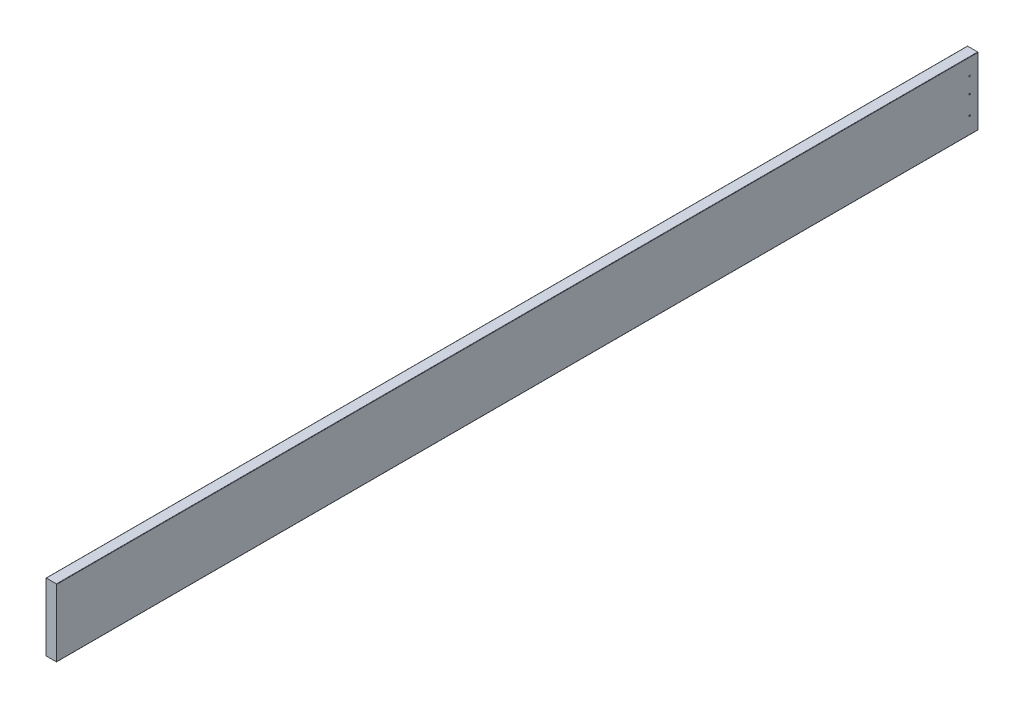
ISO-10303-21;
HEADER;
FILE_DESCRIPTION(('STEP AP214'),'2;1');
FILE_NAME('part.step','',(''),(''),'','','');
FILE_SCHEMA(('AUTOMOTIVE_DESIGN { 1 0 10303 214 1 1 1 1 }'));
ENDSEC;
DATA;
#1=APPLICATION_CONTEXT('core data for automotive mechanical design processes');
#2=APPLICATION_PROTOCOL_DEFINITION('international standard','automotive_design',2000,#1);
#3=PRODUCT_CONTEXT('',#1,'mechanical');
#4=PRODUCT('Part','Part','',(#3));
#5=PRODUCT_RELATED_PRODUCT_CATEGORY('part','',(#4));
#6=PRODUCT_DEFINITION_FORMATION('','',#4);
#7=PRODUCT_DEFINITION_CONTEXT('part definition',#1,'design');
#8=PRODUCT_DEFINITION('design','',#6,#7);
#9=PRODUCT_DEFINITION_SHAPE('','',#8);
#10=(LENGTH_UNIT() NAMED_UNIT(*) SI_UNIT(.MILLI.,.METRE.));
#11=(NAMED_UNIT(*) PLANE_ANGLE_UNIT() SI_UNIT($,.RADIAN.));
#12=(NAMED_UNIT(*) SI_UNIT($,.STERADIAN.) SOLID_ANGLE_UNIT());
#13=UNCERTAINTY_MEASURE_WITH_UNIT(LENGTH_MEASURE(1.E-05),#10,'distance_accuracy_value','');
#14=(GEOMETRIC_REPRESENTATION_CONTEXT(3) GLOBAL_UNCERTAINTY_ASSIGNED_CONTEXT((#13)) GLOBAL_UNIT_ASSIGNED_CONTEXT((#10,
#11,#12)) REPRESENTATION_CONTEXT('',''));
#15=CARTESIAN_POINT('',(0.,0.,0.));
#16=DIRECTION('',(0.,0.,1.));
#17=DIRECTION('',(1.,0.,0.));
#18=AXIS2_PLACEMENT_3D('',#15,#16,#17);
#19=CARTESIAN_POINT('',(-19.05,-120.65,3289.3));
#20=DIRECTION('',(1.,0.,0.));
#21=DIRECTION('',(0.,0.,-1.));
#22=AXIS2_PLACEMENT_3D('',#19,#20,#21);
#23=PLANE('',#22);
#24=CARTESIAN_POINT('',(-19.05,61.645760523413,29.9999999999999));
#25=DIRECTION('',(-1.,0.,0.));
#26=DIRECTION('',(0.,0.,1.));
#27=AXIS2_PLACEMENT_3D('',#24,#25,#26);
#28=CIRCLE('',#27,2.50000000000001);
#29=CARTESIAN_POINT('',(-19.05,61.645760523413,32.4999999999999));
#30=VERTEX_POINT('',#29);
#31=EDGE_CURVE('E208',#30,#30,#28,.T.);
#32=ORIENTED_EDGE('',*,*,#31,.F.);
#33=EDGE_LOOP('',(#32));
#34=FACE_BOUND('',#33,.T.);
#35=CARTESIAN_POINT('',(-19.05,5.39576052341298,29.9999999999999));
#36=DIRECTION('',(-1.,0.,0.));
#37=DIRECTION('',(0.,0.,1.));
#38=AXIS2_PLACEMENT_3D('',#35,#36,#37);
#39=CIRCLE('',#38,2.5);
#40=CARTESIAN_POINT('',(-19.05,5.39576052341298,32.4999999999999));
#41=VERTEX_POINT('',#40);
#42=EDGE_CURVE('E202',#41,#41,#39,.T.);
#43=ORIENTED_EDGE('',*,*,#42,.F.);
#44=EDGE_LOOP('',(#43));
#45=FACE_BOUND('',#44,.T.);
#46=CARTESIAN_POINT('',(-19.05,-60.854239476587,29.9999999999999));
#47=DIRECTION('',(-1.,0.,0.));
#48=DIRECTION('',(0.,0.,1.));
#49=AXIS2_PLACEMENT_3D('',#46,#47,#48);
#50=CIRCLE('',#49,2.5);
#51=CARTESIAN_POINT('',(-19.05,-60.854239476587,32.4999999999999));
#52=VERTEX_POINT('',#51);
#53=EDGE_CURVE('E196',#52,#52,#50,.T.);
#54=ORIENTED_EDGE('',*,*,#53,.F.);
#55=EDGE_LOOP('',(#54));
#56=FACE_BOUND('',#55,.T.);
#57=DIRECTION('',(0.,-1.,0.));
#58=VECTOR('',#57,1.);
#59=CARTESIAN_POINT('',(-19.05,-120.65,0.));
#60=LINE('',#59,#58);
#61=CARTESIAN_POINT('',(-19.05,119.38,0.));
#62=VERTEX_POINT('',#61);
#63=CARTESIAN_POINT('',(-19.05,-119.38,0.));
#64=VERTEX_POINT('',#63);
#65=EDGE_CURVE('E128',#62,#64,#60,.T.);
#66=ORIENTED_EDGE('',*,*,#65,.T.);
#67=DIRECTION('',(0.,0.,-1.));
#68=VECTOR('',#67,1.);
#69=CARTESIAN_POINT('',(-19.05,-119.38,3289.3));
#70=LINE('',#69,#68);
#71=CARTESIAN_POINT('',(-19.05,-119.38,3289.3));
#72=VERTEX_POINT('',#71);
#73=EDGE_CURVE('E106',#64,#72,#70,.F.);
#74=ORIENTED_EDGE('',*,*,#73,.T.);
#75=DIRECTION('',(0.,-1.,0.));
#76=VECTOR('',#75,1.);
#77=CARTESIAN_POINT('',(-19.05,-120.65,3289.3));
#78=LINE('',#77,#76);
#79=CARTESIAN_POINT('',(-19.05,119.38,3289.3));
#80=VERTEX_POINT('',#79);
#81=EDGE_CURVE('E138',#80,#72,#78,.T.);
#82=ORIENTED_EDGE('',*,*,#81,.F.);
#83=DIRECTION('',(0.,0.,-1.));
#84=VECTOR('',#83,1.);
#85=CARTESIAN_POINT('',(-19.05,119.38,3289.3));
#86=LINE('',#85,#84);
#87=EDGE_CURVE('E111',#80,#62,#86,.T.);
#88=ORIENTED_EDGE('',*,*,#87,.T.);
#89=EDGE_LOOP('',(#66,#74,#82,#88));
#90=FACE_BOUND('',#89,.T.);
#91=ADVANCED_FACE('F35',(#34,#45,#56,#90),#23,.F.);
#92=CARTESIAN_POINT('',(-19.05,-120.65,3289.3));
#93=DIRECTION('',(0.,1.,0.));
#94=DIRECTION('',(0.,0.,1.));
#95=AXIS2_PLACEMENT_3D('',#92,#93,#94);
#96=PLANE('',#95);
#97=DIRECTION('',(1.,0.,0.));
#98=VECTOR('',#97,1.);
#99=CARTESIAN_POINT('',(-19.05,-120.65,3289.3));
#100=LINE('',#99,#98);
#101=CARTESIAN_POINT('',(-17.78,-120.65,3289.3));
#102=VERTEX_POINT('',#101);
#103=CARTESIAN_POINT('',(17.78,-120.65,3289.3));
#104=VERTEX_POINT('',#103);
#105=EDGE_CURVE('E121',#102,#104,#100,.T.);
#106=ORIENTED_EDGE('',*,*,#105,.F.);
#107=DIRECTION('',(0.,0.,-1.));
#108=VECTOR('',#107,1.);
#109=CARTESIAN_POINT('',(-17.78,-120.65,3289.3));
#110=LINE('',#109,#108);
#111=CARTESIAN_POINT('',(-17.78,-120.65,0.));
#112=VERTEX_POINT('',#111);
#113=EDGE_CURVE('E105',#102,#112,#110,.T.);
#114=ORIENTED_EDGE('',*,*,#113,.T.);
#115=DIRECTION('',(1.,0.,0.));
#116=VECTOR('',#115,1.);
#117=CARTESIAN_POINT('',(-19.05,-120.65,0.));
#118=LINE('',#117,#116);
#119=CARTESIAN_POINT('',(17.78,-120.65,0.));
#120=VERTEX_POINT('',#119);
#121=EDGE_CURVE('E118',#112,#120,#118,.T.);
#122=ORIENTED_EDGE('',*,*,#121,.T.);
#123=DIRECTION('',(0.,0.,-1.));
#124=VECTOR('',#123,1.);
#125=CARTESIAN_POINT('',(17.78,-120.65,3289.3));
#126=LINE('',#125,#124);
#127=EDGE_CURVE('E123',#120,#104,#126,.F.);
#128=ORIENTED_EDGE('',*,*,#127,.T.);
#129=EDGE_LOOP('',(#106,#114,#122,#128));
#130=FACE_BOUND('',#129,.T.);
#131=ADVANCED_FACE('F117',(#130),#96,.F.);
#132=CARTESIAN_POINT('',(19.05,-120.65,3289.3));
#133=DIRECTION('',(-1.,0.,0.));
#134=DIRECTION('',(0.,-1.,0.));
#135=AXIS2_PLACEMENT_3D('',#132,#133,#134);
#136=PLANE('',#135);
#137=CARTESIAN_POINT('',(19.05,61.6457605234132,30.0000000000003));
#138=DIRECTION('',(1.,0.,0.));
#139=DIRECTION('',(0.,1.,0.));
#140=AXIS2_PLACEMENT_3D('',#137,#138,#139);
#141=CIRCLE('',#140,2.5);
#142=CARTESIAN_POINT('',(19.05,64.1457605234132,30.0000000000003));
#143=VERTEX_POINT('',#142);
#144=EDGE_CURVE('E190',#143,#143,#141,.T.);
#145=ORIENTED_EDGE('',*,*,#144,.F.);
#146=EDGE_LOOP('',(#145));
#147=FACE_BOUND('',#146,.T.);
#148=CARTESIAN_POINT('',(19.05,5.39576052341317,30.0000000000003));
#149=DIRECTION('',(1.,0.,0.));
#150=DIRECTION('',(0.,1.,0.));
#151=AXIS2_PLACEMENT_3D('',#148,#149,#150);
#152=CIRCLE('',#151,2.5);
#153=CARTESIAN_POINT('',(19.05,7.89576052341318,30.0000000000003));
#154=VERTEX_POINT('',#153);
#155=EDGE_CURVE('E184',#154,#154,#152,.T.);
#156=ORIENTED_EDGE('',*,*,#155,.F.);
#157=EDGE_LOOP('',(#156));
#158=FACE_BOUND('',#157,.T.);
#159=CARTESIAN_POINT('',(19.05,-60.8542394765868,30.0000000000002));
#160=DIRECTION('',(1.,0.,0.));
#161=DIRECTION('',(0.,1.,0.));
#162=AXIS2_PLACEMENT_3D('',#159,#160,#161);
#163=CIRCLE('',#162,2.50000000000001);
#164=CARTESIAN_POINT('',(19.05,-58.3542394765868,30.0000000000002));
#165=VERTEX_POINT('',#164);
#166=EDGE_CURVE('E178',#165,#165,#163,.T.);
#167=ORIENTED_EDGE('',*,*,#166,.F.);
#168=EDGE_LOOP('',(#167));
#169=FACE_BOUND('',#168,.T.);
#170=DIRECTION('',(0.,1.,0.));
#171=VECTOR('',#170,1.);
#172=CARTESIAN_POINT('',(19.05,-120.65,3289.3));
#173=LINE('',#172,#171);
#174=CARTESIAN_POINT('',(19.05,-119.38,3289.3));
#175=VERTEX_POINT('',#174);
#176=CARTESIAN_POINT('',(19.05,119.38,3289.3));
#177=VERTEX_POINT('',#176);
#178=EDGE_CURVE('E164',#175,#177,#173,.T.);
#179=ORIENTED_EDGE('',*,*,#178,.F.);
#180=DIRECTION('',(0.,0.,-1.));
#181=VECTOR('',#180,1.);
#182=CARTESIAN_POINT('',(19.05,-119.38,3289.3));
#183=LINE('',#182,#181);
#184=CARTESIAN_POINT('',(19.05,-119.38,0.));
#185=VERTEX_POINT('',#184);
#186=EDGE_CURVE('E157',#175,#185,#183,.T.);
#187=ORIENTED_EDGE('',*,*,#186,.T.);
#188=DIRECTION('',(0.,1.,0.));
#189=VECTOR('',#188,1.);
#190=CARTESIAN_POINT('',(19.05,-120.65,0.));
#191=LINE('',#190,#189);
#192=CARTESIAN_POINT('',(19.05,119.38,0.));
#193=VERTEX_POINT('',#192);
#194=EDGE_CURVE('E127',#185,#193,#191,.T.);
#195=ORIENTED_EDGE('',*,*,#194,.T.);
#196=DIRECTION('',(0.,0.,-1.));
#197=VECTOR('',#196,1.);
#198=CARTESIAN_POINT('',(19.05,119.38,3289.3));
#199=LINE('',#198,#197);
#200=EDGE_CURVE('E155',#193,#177,#199,.F.);
#201=ORIENTED_EDGE('',*,*,#200,.T.);
#202=EDGE_LOOP('',(#179,#187,#195,#201));
#203=FACE_BOUND('',#202,.T.);
#204=ADVANCED_FACE('F162',(#147,#158,#169,#203),#136,.F.);
#205=CARTESIAN_POINT('',(-19.05,120.65,3289.3));
#206=DIRECTION('',(0.,-1.,0.));
#207=DIRECTION('',(0.,0.,-1.));
#208=AXIS2_PLACEMENT_3D('',#205,#206,#207);
#209=PLANE('',#208);
#210=DIRECTION('',(-1.,0.,0.));
#211=VECTOR('',#210,1.);
#212=CARTESIAN_POINT('',(-19.05,120.65,3289.3));
#213=LINE('',#212,#211);
#214=CARTESIAN_POINT('',(17.78,120.65,3289.3));
#215=VERTEX_POINT('',#214);
#216=CARTESIAN_POINT('',(-17.78,120.65,3289.3));
#217=VERTEX_POINT('',#216);
#218=EDGE_CURVE('E139',#215,#217,#213,.T.);
#219=ORIENTED_EDGE('',*,*,#218,.F.);
#220=DIRECTION('',(0.,0.,-1.));
#221=VECTOR('',#220,1.);
#222=CARTESIAN_POINT('',(17.78,120.65,3289.3));
#223=LINE('',#222,#221);
#224=CARTESIAN_POINT('',(17.78,120.65,0.));
#225=VERTEX_POINT('',#224);
#226=EDGE_CURVE('E11',#215,#225,#223,.T.);
#227=ORIENTED_EDGE('',*,*,#226,.T.);
#228=DIRECTION('',(-1.,0.,0.));
#229=VECTOR('',#228,1.);
#230=CARTESIAN_POINT('',(-19.05,120.65,0.));
#231=LINE('',#230,#229);
#232=CARTESIAN_POINT('',(-17.78,120.65,0.));
#233=VERTEX_POINT('',#232);
#234=EDGE_CURVE('E131',#225,#233,#231,.T.);
#235=ORIENTED_EDGE('',*,*,#234,.T.);
#236=DIRECTION('',(0.,0.,-1.));
#237=VECTOR('',#236,1.);
#238=CARTESIAN_POINT('',(-17.78,120.65,3289.3));
#239=LINE('',#238,#237);
#240=EDGE_CURVE('E43',#233,#217,#239,.F.);
#241=ORIENTED_EDGE('',*,*,#240,.T.);
#242=EDGE_LOOP('',(#219,#227,#235,#241));
#243=FACE_BOUND('',#242,.T.);
#244=ADVANCED_FACE('F171',(#243),#209,.F.);
#245=CARTESIAN_POINT('',(-19.05,120.65,3289.3));
#246=DIRECTION('',(0.,0.,-1.));
#247=DIRECTION('',(-1.,0.,0.));
#248=AXIS2_PLACEMENT_3D('',#245,#246,#247);
#249=PLANE('',#248);
#250=ORIENTED_EDGE('',*,*,#81,.T.);
#251=CARTESIAN_POINT('',(-17.78,-119.38,3289.3));
#252=DIRECTION('',(0.,0.,-1.));
#253=DIRECTION('',(-1.,0.,0.));
#254=AXIS2_PLACEMENT_3D('',#251,#252,#253);
#255=CIRCLE('',#254,1.27);
#256=EDGE_CURVE('E153',#72,#102,#255,.F.);
#257=ORIENTED_EDGE('',*,*,#256,.T.);
#258=ORIENTED_EDGE('',*,*,#105,.T.);
#259=CARTESIAN_POINT('',(17.78,-119.38,3289.3));
#260=DIRECTION('',(0.,0.,-1.));
#261=DIRECTION('',(-1.,0.,0.));
#262=AXIS2_PLACEMENT_3D('',#259,#260,#261);
#263=CIRCLE('',#262,1.27);
#264=EDGE_CURVE('E151',#104,#175,#263,.F.);
#265=ORIENTED_EDGE('',*,*,#264,.T.);
#266=ORIENTED_EDGE('',*,*,#178,.T.);
#267=CARTESIAN_POINT('',(17.78,119.38,3289.3));
#268=DIRECTION('',(0.,0.,-1.));
#269=DIRECTION('',(-1.,0.,0.));
#270=AXIS2_PLACEMENT_3D('',#267,#268,#269);
#271=CIRCLE('',#270,1.27);
#272=EDGE_CURVE('E56',#177,#215,#271,.F.);
#273=ORIENTED_EDGE('',*,*,#272,.T.);
#274=ORIENTED_EDGE('',*,*,#218,.T.);
#275=CARTESIAN_POINT('',(-17.78,119.38,3289.3));
#276=DIRECTION('',(0.,0.,-1.));
#277=DIRECTION('',(-1.,0.,0.));
#278=AXIS2_PLACEMENT_3D('',#275,#276,#277);
#279=CIRCLE('',#278,1.27);
#280=EDGE_CURVE('E148',#217,#80,#279,.F.);
#281=ORIENTED_EDGE('',*,*,#280,.T.);
#282=EDGE_LOOP('',(#250,#257,#258,#265,#266,#273,#274,#281));
#283=FACE_BOUND('',#282,.T.);
#284=ADVANCED_FACE('F233',(#283),#249,.F.);
#285=CARTESIAN_POINT('',(-19.05,120.65,0.));
#286=DIRECTION('',(0.,0.,-1.));
#287=DIRECTION('',(-1.,0.,0.));
#288=AXIS2_PLACEMENT_3D('',#285,#286,#287);
#289=PLANE('',#288);
#290=ORIENTED_EDGE('',*,*,#121,.F.);
#291=CARTESIAN_POINT('',(-17.78,-119.38,0.));
#292=DIRECTION('',(0.,0.,-1.));
#293=DIRECTION('',(-1.,0.,0.));
#294=AXIS2_PLACEMENT_3D('',#291,#292,#293);
#295=CIRCLE('',#294,1.27);
#296=EDGE_CURVE('E101',#112,#64,#295,.T.);
#297=ORIENTED_EDGE('',*,*,#296,.T.);
#298=ORIENTED_EDGE('',*,*,#65,.F.);
#299=CARTESIAN_POINT('',(-17.78,119.38,0.));
#300=DIRECTION('',(0.,0.,-1.));
#301=DIRECTION('',(-1.,0.,0.));
#302=AXIS2_PLACEMENT_3D('',#299,#300,#301);
#303=CIRCLE('',#302,1.27);
#304=EDGE_CURVE('E122',#62,#233,#303,.T.);
#305=ORIENTED_EDGE('',*,*,#304,.T.);
#306=ORIENTED_EDGE('',*,*,#234,.F.);
#307=CARTESIAN_POINT('',(17.78,119.38,0.));
#308=DIRECTION('',(0.,0.,-1.));
#309=DIRECTION('',(-1.,0.,0.));
#310=AXIS2_PLACEMENT_3D('',#307,#308,#309);
#311=CIRCLE('',#310,1.27);
#312=EDGE_CURVE('E142',#225,#193,#311,.T.);
#313=ORIENTED_EDGE('',*,*,#312,.T.);
#314=ORIENTED_EDGE('',*,*,#194,.F.);
#315=CARTESIAN_POINT('',(17.78,-119.38,0.));
#316=DIRECTION('',(0.,0.,-1.));
#317=DIRECTION('',(-1.,0.,0.));
#318=AXIS2_PLACEMENT_3D('',#315,#316,#317);
#319=CIRCLE('',#318,1.27);
#320=EDGE_CURVE('E112',#185,#120,#319,.T.);
#321=ORIENTED_EDGE('',*,*,#320,.T.);
#322=EDGE_LOOP('',(#290,#297,#298,#305,#306,#313,#314,#321));
#323=FACE_BOUND('',#322,.T.);
#324=ADVANCED_FACE('F125',(#323),#289,.T.);
#325=CARTESIAN_POINT('',(-17.78,-119.38,3289.3));
#326=DIRECTION('',(0.,0.,-1.));
#327=DIRECTION('',(-1.,0.,0.));
#328=AXIS2_PLACEMENT_3D('',#325,#326,#327);
#329=CYLINDRICAL_SURFACE('',#328,1.27);
#330=ORIENTED_EDGE('',*,*,#256,.F.);
#331=ORIENTED_EDGE('',*,*,#73,.F.);
#332=ORIENTED_EDGE('',*,*,#296,.F.);
#333=ORIENTED_EDGE('',*,*,#113,.F.);
#334=EDGE_LOOP('',(#330,#331,#332,#333));
#335=FACE_BOUND('',#334,.T.);
#336=ADVANCED_FACE('F104',(#335),#329,.T.);
#337=CARTESIAN_POINT('',(17.78,-119.38,3289.3));
#338=DIRECTION('',(0.,0.,-1.));
#339=DIRECTION('',(-1.,0.,0.));
#340=AXIS2_PLACEMENT_3D('',#337,#338,#339);
#341=CYLINDRICAL_SURFACE('',#340,1.27);
#342=ORIENTED_EDGE('',*,*,#264,.F.);
#343=ORIENTED_EDGE('',*,*,#127,.F.);
#344=ORIENTED_EDGE('',*,*,#320,.F.);
#345=ORIENTED_EDGE('',*,*,#186,.F.);
#346=EDGE_LOOP('',(#342,#343,#344,#345));
#347=FACE_BOUND('',#346,.T.);
#348=ADVANCED_FACE('F234',(#347),#341,.T.);
#349=CARTESIAN_POINT('',(17.78,119.38,3289.3));
#350=DIRECTION('',(0.,0.,-1.));
#351=DIRECTION('',(-1.,0.,0.));
#352=AXIS2_PLACEMENT_3D('',#349,#350,#351);
#353=CYLINDRICAL_SURFACE('',#352,1.27);
#354=ORIENTED_EDGE('',*,*,#272,.F.);
#355=ORIENTED_EDGE('',*,*,#200,.F.);
#356=ORIENTED_EDGE('',*,*,#312,.F.);
#357=ORIENTED_EDGE('',*,*,#226,.F.);
#358=EDGE_LOOP('',(#354,#355,#356,#357));
#359=FACE_BOUND('',#358,.T.);
#360=ADVANCED_FACE('F170',(#359),#353,.T.);
#361=CARTESIAN_POINT('',(-17.78,119.38,3289.3));
#362=DIRECTION('',(0.,0.,-1.));
#363=DIRECTION('',(-1.,0.,0.));
#364=AXIS2_PLACEMENT_3D('',#361,#362,#363);
#365=CYLINDRICAL_SURFACE('',#364,1.27);
#366=ORIENTED_EDGE('',*,*,#280,.F.);
#367=ORIENTED_EDGE('',*,*,#240,.F.);
#368=ORIENTED_EDGE('',*,*,#304,.F.);
#369=ORIENTED_EDGE('',*,*,#87,.F.);
#370=EDGE_LOOP('',(#366,#367,#368,#369));
#371=FACE_BOUND('',#370,.T.);
#372=ADVANCED_FACE('F37',(#371),#365,.T.);
#373=CARTESIAN_POINT('',(1.27,-60.8542394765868,30.0000000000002));
#374=DIRECTION('',(1.,0.,0.));
#375=DIRECTION('',(0.,1.,0.));
#376=AXIS2_PLACEMENT_3D('',#373,#374,#375);
#377=CYLINDRICAL_SURFACE('',#376,2.50000000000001);
#378=CARTESIAN_POINT('',(1.27,-60.8542394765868,30.0000000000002));
#379=DIRECTION('',(1.,0.,0.));
#380=DIRECTION('',(0.,1.,0.));
#381=AXIS2_PLACEMENT_3D('',#378,#379,#380);
#382=CIRCLE('',#381,2.50000000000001);
#383=CARTESIAN_POINT('',(1.27,-58.3542394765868,30.0000000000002));
#384=VERTEX_POINT('',#383);
#385=EDGE_CURVE('E133',#384,#384,#382,.T.);
#386=ORIENTED_EDGE('',*,*,#385,.F.);
#387=EDGE_LOOP('',(#386));
#388=FACE_BOUND('',#387,.T.);
#389=ORIENTED_EDGE('',*,*,#166,.T.);
#390=EDGE_LOOP('',(#389));
#391=FACE_BOUND('',#390,.T.);
#392=ADVANCED_FACE('F254',(#388,#391),#377,.F.);
#393=CARTESIAN_POINT('',(1.27,-60.8542394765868,30.0000000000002));
#394=DIRECTION('',(1.,0.,0.));
#395=DIRECTION('',(0.,1.,0.));
#396=AXIS2_PLACEMENT_3D('',#393,#394,#395);
#397=PLANE('',#396);
#398=ORIENTED_EDGE('',*,*,#385,.T.);
#399=EDGE_LOOP('',(#398));
#400=FACE_BOUND('',#399,.T.);
#401=ADVANCED_FACE('F257',(#400),#397,.T.);
#402=CARTESIAN_POINT('',(1.27,5.39576052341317,30.0000000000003));
#403=DIRECTION('',(1.,0.,0.));
#404=DIRECTION('',(0.,1.,0.));
#405=AXIS2_PLACEMENT_3D('',#402,#403,#404);
#406=CYLINDRICAL_SURFACE('',#405,2.5);
#407=CARTESIAN_POINT('',(1.27,5.39576052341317,30.0000000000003));
#408=DIRECTION('',(1.,0.,0.));
#409=DIRECTION('',(0.,1.,0.));
#410=AXIS2_PLACEMENT_3D('',#407,#408,#409);
#411=CIRCLE('',#410,2.5);
#412=CARTESIAN_POINT('',(1.27,7.89576052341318,30.0000000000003));
#413=VERTEX_POINT('',#412);
#414=EDGE_CURVE('E181',#413,#413,#411,.T.);
#415=ORIENTED_EDGE('',*,*,#414,.F.);
#416=EDGE_LOOP('',(#415));
#417=FACE_BOUND('',#416,.T.);
#418=ORIENTED_EDGE('',*,*,#155,.T.);
#419=EDGE_LOOP('',(#418));
#420=FACE_BOUND('',#419,.T.);
#421=ADVANCED_FACE('F261',(#417,#420),#406,.F.);
#422=CARTESIAN_POINT('',(1.27,5.39576052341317,30.0000000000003));
#423=DIRECTION('',(1.,0.,0.));
#424=DIRECTION('',(0.,1.,0.));
#425=AXIS2_PLACEMENT_3D('',#422,#423,#424);
#426=PLANE('',#425);
#427=ORIENTED_EDGE('',*,*,#414,.T.);
#428=EDGE_LOOP('',(#427));
#429=FACE_BOUND('',#428,.T.);
#430=ADVANCED_FACE('F265',(#429),#426,.T.);
#431=CARTESIAN_POINT('',(1.27,61.6457605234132,30.0000000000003));
#432=DIRECTION('',(1.,0.,0.));
#433=DIRECTION('',(0.,1.,0.));
#434=AXIS2_PLACEMENT_3D('',#431,#432,#433);
#435=CYLINDRICAL_SURFACE('',#434,2.5);
#436=CARTESIAN_POINT('',(1.27,61.6457605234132,30.0000000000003));
#437=DIRECTION('',(1.,0.,0.));
#438=DIRECTION('',(0.,1.,0.));
#439=AXIS2_PLACEMENT_3D('',#436,#437,#438);
#440=CIRCLE('',#439,2.5);
#441=CARTESIAN_POINT('',(1.27,64.1457605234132,30.0000000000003));
#442=VERTEX_POINT('',#441);
#443=EDGE_CURVE('E187',#442,#442,#440,.T.);
#444=ORIENTED_EDGE('',*,*,#443,.F.);
#445=EDGE_LOOP('',(#444));
#446=FACE_BOUND('',#445,.T.);
#447=ORIENTED_EDGE('',*,*,#144,.T.);
#448=EDGE_LOOP('',(#447));
#449=FACE_BOUND('',#448,.T.);
#450=ADVANCED_FACE('F269',(#446,#449),#435,.F.);
#451=CARTESIAN_POINT('',(1.27,61.6457605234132,30.0000000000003));
#452=DIRECTION('',(1.,0.,0.));
#453=DIRECTION('',(0.,1.,0.));
#454=AXIS2_PLACEMENT_3D('',#451,#452,#453);
#455=PLANE('',#454);
#456=ORIENTED_EDGE('',*,*,#443,.T.);
#457=EDGE_LOOP('',(#456));
#458=FACE_BOUND('',#457,.T.);
#459=ADVANCED_FACE('F273',(#458),#455,.T.);
#460=CARTESIAN_POINT('',(-1.27000000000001,-60.854239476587,29.9999999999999));
#461=DIRECTION('',(-1.,0.,0.));
#462=DIRECTION('',(0.,0.,1.));
#463=AXIS2_PLACEMENT_3D('',#460,#461,#462);
#464=CYLINDRICAL_SURFACE('',#463,2.5);
#465=CARTESIAN_POINT('',(-1.27000000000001,-60.854239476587,29.9999999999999));
#466=DIRECTION('',(-1.,0.,0.));
#467=DIRECTION('',(0.,0.,1.));
#468=AXIS2_PLACEMENT_3D('',#465,#466,#467);
#469=CIRCLE('',#468,2.5);
#470=CARTESIAN_POINT('',(-1.27000000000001,-60.854239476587,32.4999999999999));
#471=VERTEX_POINT('',#470);
#472=EDGE_CURVE('E193',#471,#471,#469,.T.);
#473=ORIENTED_EDGE('',*,*,#472,.F.);
#474=EDGE_LOOP('',(#473));
#475=FACE_BOUND('',#474,.T.);
#476=ORIENTED_EDGE('',*,*,#53,.T.);
#477=EDGE_LOOP('',(#476));
#478=FACE_BOUND('',#477,.T.);
#479=ADVANCED_FACE('F277',(#475,#478),#464,.F.);
#480=CARTESIAN_POINT('',(-1.27000000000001,-60.854239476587,29.9999999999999));
#481=DIRECTION('',(-1.,0.,0.));
#482=DIRECTION('',(0.,0.,1.));
#483=AXIS2_PLACEMENT_3D('',#480,#481,#482);
#484=PLANE('',#483);
#485=ORIENTED_EDGE('',*,*,#472,.T.);
#486=EDGE_LOOP('',(#485));
#487=FACE_BOUND('',#486,.T.);
#488=ADVANCED_FACE('F281',(#487),#484,.T.);
#489=CARTESIAN_POINT('',(-1.27000000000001,5.39576052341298,29.9999999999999));
#490=DIRECTION('',(-1.,0.,0.));
#491=DIRECTION('',(0.,0.,1.));
#492=AXIS2_PLACEMENT_3D('',#489,#490,#491);
#493=CYLINDRICAL_SURFACE('',#492,2.5);
#494=CARTESIAN_POINT('',(-1.27000000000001,5.39576052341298,29.9999999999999));
#495=DIRECTION('',(-1.,0.,0.));
#496=DIRECTION('',(0.,0.,1.));
#497=AXIS2_PLACEMENT_3D('',#494,#495,#496);
#498=CIRCLE('',#497,2.5);
#499=CARTESIAN_POINT('',(-1.27000000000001,5.39576052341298,32.4999999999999));
#500=VERTEX_POINT('',#499);
#501=EDGE_CURVE('E199',#500,#500,#498,.T.);
#502=ORIENTED_EDGE('',*,*,#501,.F.);
#503=EDGE_LOOP('',(#502));
#504=FACE_BOUND('',#503,.T.);
#505=ORIENTED_EDGE('',*,*,#42,.T.);
#506=EDGE_LOOP('',(#505));
#507=FACE_BOUND('',#506,.T.);
#508=ADVANCED_FACE('F285',(#504,#507),#493,.F.);
#509=CARTESIAN_POINT('',(-1.27000000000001,5.39576052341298,29.9999999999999));
#510=DIRECTION('',(-1.,0.,0.));
#511=DIRECTION('',(0.,0.,1.));
#512=AXIS2_PLACEMENT_3D('',#509,#510,#511);
#513=PLANE('',#512);
#514=ORIENTED_EDGE('',*,*,#501,.T.);
#515=EDGE_LOOP('',(#514));
#516=FACE_BOUND('',#515,.T.);
#517=ADVANCED_FACE('F219',(#516),#513,.T.);
#518=CARTESIAN_POINT('',(-1.27000000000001,61.645760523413,29.9999999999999));
#519=DIRECTION('',(-1.,0.,0.));
#520=DIRECTION('',(0.,0.,1.));
#521=AXIS2_PLACEMENT_3D('',#518,#519,#520);
#522=CYLINDRICAL_SURFACE('',#521,2.50000000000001);
#523=CARTESIAN_POINT('',(-1.27000000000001,61.645760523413,29.9999999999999));
#524=DIRECTION('',(-1.,0.,0.));
#525=DIRECTION('',(0.,0.,1.));
#526=AXIS2_PLACEMENT_3D('',#523,#524,#525);
#527=CIRCLE('',#526,2.50000000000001);
#528=CARTESIAN_POINT('',(-1.27000000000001,61.645760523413,32.4999999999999));
#529=VERTEX_POINT('',#528);
#530=EDGE_CURVE('E205',#529,#529,#527,.T.);
#531=ORIENTED_EDGE('',*,*,#530,.F.);
#532=EDGE_LOOP('',(#531));
#533=FACE_BOUND('',#532,.T.);
#534=ORIENTED_EDGE('',*,*,#31,.T.);
#535=EDGE_LOOP('',(#534));
#536=FACE_BOUND('',#535,.T.);
#537=ADVANCED_FACE('F216',(#533,#536),#522,.F.);
#538=CARTESIAN_POINT('',(-1.27000000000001,61.645760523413,29.9999999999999));
#539=DIRECTION('',(-1.,0.,0.));
#540=DIRECTION('',(0.,0.,1.));
#541=AXIS2_PLACEMENT_3D('',#538,#539,#540);
#542=PLANE('',#541);
#543=ORIENTED_EDGE('',*,*,#530,.T.);
#544=EDGE_LOOP('',(#543));
#545=FACE_BOUND('',#544,.T.);
#546=ADVANCED_FACE('F214',(#545),#542,.T.);
#547=CLOSED_SHELL('',(#91,#131,#204,#244,#284,#324,#336,#348,#360,#372,#392,#401,#421,#430,#450,
#459,#479,#488,#508,#517,#537,#546));
#548=MANIFOLD_SOLID_BREP('B2',#547);
#549=ADVANCED_BREP_SHAPE_REPRESENTATION('',(#18,#548),#14);
#550=SHAPE_DEFINITION_REPRESENTATION(#9,#549);
ENDSEC;
END-ISO-10303-21;
